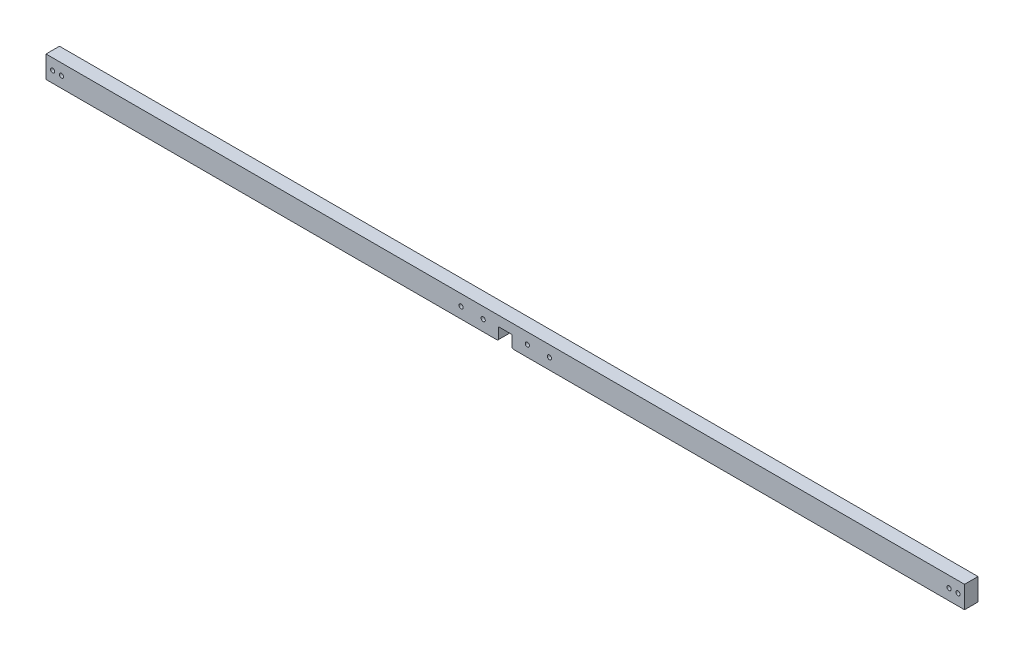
ISO-10303-21;
HEADER;
FILE_DESCRIPTION(('STEP AP214'),'2;1');
FILE_NAME('part.step','',(''),(''),'','','');
FILE_SCHEMA(('AUTOMOTIVE_DESIGN { 1 0 10303 214 1 1 1 1 }'));
ENDSEC;
DATA;
#1=APPLICATION_CONTEXT('core data for automotive mechanical design processes');
#2=APPLICATION_PROTOCOL_DEFINITION('international standard','automotive_design',2000,#1);
#3=PRODUCT_CONTEXT('',#1,'mechanical');
#4=PRODUCT('Part','Part','',(#3));
#5=PRODUCT_RELATED_PRODUCT_CATEGORY('part','',(#4));
#6=PRODUCT_DEFINITION_FORMATION('','',#4);
#7=PRODUCT_DEFINITION_CONTEXT('part definition',#1,'design');
#8=PRODUCT_DEFINITION('design','',#6,#7);
#9=PRODUCT_DEFINITION_SHAPE('','',#8);
#10=(LENGTH_UNIT() NAMED_UNIT(*) SI_UNIT(.MILLI.,.METRE.));
#11=(NAMED_UNIT(*) PLANE_ANGLE_UNIT() SI_UNIT($,.RADIAN.));
#12=(NAMED_UNIT(*) SI_UNIT($,.STERADIAN.) SOLID_ANGLE_UNIT());
#13=UNCERTAINTY_MEASURE_WITH_UNIT(LENGTH_MEASURE(1.E-05),#10,'distance_accuracy_value','');
#14=(GEOMETRIC_REPRESENTATION_CONTEXT(3) GLOBAL_UNCERTAINTY_ASSIGNED_CONTEXT((#13)) GLOBAL_UNIT_ASSIGNED_CONTEXT((#10,
#11,#12)) REPRESENTATION_CONTEXT('',''));
#15=CARTESIAN_POINT('',(0.,0.,0.));
#16=DIRECTION('',(0.,0.,1.));
#17=DIRECTION('',(1.,0.,0.));
#18=AXIS2_PLACEMENT_3D('',#15,#16,#17);
#19=CARTESIAN_POINT('',(208.,-4.99999999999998,3.05));
#20=DIRECTION('',(0.,1.,0.));
#21=DIRECTION('',(-1.,0.,0.));
#22=AXIS2_PLACEMENT_3D('',#19,#20,#21);
#23=PLANE('',#22);
#24=DIRECTION('',(1.,0.,0.));
#25=VECTOR('',#24,1.);
#26=CARTESIAN_POINT('',(208.,-4.99999999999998,3.05));
#27=LINE('',#26,#25);
#28=CARTESIAN_POINT('',(3.50000000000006,-5.,3.05));
#29=VERTEX_POINT('',#28);
#30=CARTESIAN_POINT('',(208.,-4.99999999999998,3.05));
#31=VERTEX_POINT('',#30);
#32=EDGE_CURVE('E189',#29,#31,#27,.T.);
#33=ORIENTED_EDGE('',*,*,#32,.F.);
#34=DIRECTION('',(0.,0.,-1.));
#35=VECTOR('',#34,1.);
#36=CARTESIAN_POINT('',(3.5,-5.,3.05));
#37=LINE('',#36,#35);
#38=CARTESIAN_POINT('',(3.50000000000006,-5.,-3.05));
#39=VERTEX_POINT('',#38);
#40=EDGE_CURVE('E224',#29,#39,#37,.T.);
#41=ORIENTED_EDGE('',*,*,#40,.T.);
#42=DIRECTION('',(1.,0.,0.));
#43=VECTOR('',#42,1.);
#44=CARTESIAN_POINT('',(208.,-4.99999999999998,-3.05));
#45=LINE('',#44,#43);
#46=CARTESIAN_POINT('',(208.,-4.99999999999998,-3.05));
#47=VERTEX_POINT('',#46);
#48=EDGE_CURVE('E200',#39,#47,#45,.T.);
#49=ORIENTED_EDGE('',*,*,#48,.T.);
#50=DIRECTION('',(0.,0.,-1.));
#51=VECTOR('',#50,1.);
#52=CARTESIAN_POINT('',(208.,-4.99999999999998,3.05));
#53=LINE('',#52,#51);
#54=EDGE_CURVE('E212',#31,#47,#53,.T.);
#55=ORIENTED_EDGE('',*,*,#54,.F.);
#56=EDGE_LOOP('',(#33,#41,#49,#55));
#57=FACE_BOUND('',#56,.T.);
#58=ADVANCED_FACE('F34',(#57),#23,.F.);
#59=CARTESIAN_POINT('',(-208.,-5.00000000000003,3.05));
#60=DIRECTION('',(1.,0.,0.));
#61=DIRECTION('',(0.,0.,-1.));
#62=AXIS2_PLACEMENT_3D('',#59,#60,#61);
#63=PLANE('',#62);
#64=DIRECTION('',(0.,-1.,0.));
#65=VECTOR('',#64,1.);
#66=CARTESIAN_POINT('',(-208.,-5.00000000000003,-3.05));
#67=LINE('',#66,#65);
#68=CARTESIAN_POINT('',(-208.,4.99999999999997,-3.05));
#69=VERTEX_POINT('',#68);
#70=CARTESIAN_POINT('',(-208.,-5.00000000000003,-3.05));
#71=VERTEX_POINT('',#70);
#72=EDGE_CURVE('E165',#69,#71,#67,.T.);
#73=ORIENTED_EDGE('',*,*,#72,.T.);
#74=DIRECTION('',(0.,0.,-1.));
#75=VECTOR('',#74,1.);
#76=CARTESIAN_POINT('',(-208.,-5.00000000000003,3.05));
#77=LINE('',#76,#75);
#78=CARTESIAN_POINT('',(-208.,-5.00000000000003,3.05));
#79=VERTEX_POINT('',#78);
#80=EDGE_CURVE('E215',#79,#71,#77,.T.);
#81=ORIENTED_EDGE('',*,*,#80,.F.);
#82=DIRECTION('',(0.,-1.,0.));
#83=VECTOR('',#82,1.);
#84=CARTESIAN_POINT('',(-208.,-5.00000000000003,3.05));
#85=LINE('',#84,#83);
#86=CARTESIAN_POINT('',(-208.,4.99999999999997,3.05));
#87=VERTEX_POINT('',#86);
#88=EDGE_CURVE('E186',#87,#79,#85,.T.);
#89=ORIENTED_EDGE('',*,*,#88,.F.);
#90=DIRECTION('',(0.,0.,-1.));
#91=VECTOR('',#90,1.);
#92=CARTESIAN_POINT('',(-208.,4.99999999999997,3.05));
#93=LINE('',#92,#91);
#94=EDGE_CURVE('E197',#87,#69,#93,.T.);
#95=ORIENTED_EDGE('',*,*,#94,.T.);
#96=EDGE_LOOP('',(#73,#81,#89,#95));
#97=FACE_BOUND('',#96,.T.);
#98=ADVANCED_FACE('F242',(#97),#63,.F.);
#99=CARTESIAN_POINT('',(-3.5,-5.,-3.05));
#100=VERTEX_POINT('',#99);
#101=EDGE_CURVE('E201',#71,#100,#45,.T.);
#102=ORIENTED_EDGE('',*,*,#101,.T.);
#103=DIRECTION('',(0.,0.,1.));
#104=VECTOR('',#103,1.);
#105=CARTESIAN_POINT('',(-3.50000000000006,-5.,3.05));
#106=LINE('',#105,#104);
#107=CARTESIAN_POINT('',(-3.5,-5.,3.05));
#108=VERTEX_POINT('',#107);
#109=EDGE_CURVE('E42',#100,#108,#106,.T.);
#110=ORIENTED_EDGE('',*,*,#109,.T.);
#111=EDGE_CURVE('E191',#79,#108,#27,.T.);
#112=ORIENTED_EDGE('',*,*,#111,.F.);
#113=ORIENTED_EDGE('',*,*,#80,.T.);
#114=EDGE_LOOP('',(#102,#110,#112,#113));
#115=FACE_BOUND('',#114,.T.);
#116=ADVANCED_FACE('F235',(#115),#23,.F.);
#117=CARTESIAN_POINT('',(208.,-4.99999999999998,3.05));
#118=DIRECTION('',(-1.,0.,0.));
#119=DIRECTION('',(0.,0.,1.));
#120=AXIS2_PLACEMENT_3D('',#117,#118,#119);
#121=PLANE('',#120);
#122=DIRECTION('',(0.,1.,0.));
#123=VECTOR('',#122,1.);
#124=CARTESIAN_POINT('',(208.,-4.99999999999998,-3.05));
#125=LINE('',#124,#123);
#126=CARTESIAN_POINT('',(208.,5.00000000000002,-3.05));
#127=VERTEX_POINT('',#126);
#128=EDGE_CURVE('E204',#47,#127,#125,.T.);
#129=ORIENTED_EDGE('',*,*,#128,.T.);
#130=DIRECTION('',(0.,0.,-1.));
#131=VECTOR('',#130,1.);
#132=CARTESIAN_POINT('',(208.,5.00000000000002,3.05));
#133=LINE('',#132,#131);
#134=CARTESIAN_POINT('',(208.,5.00000000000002,3.05));
#135=VERTEX_POINT('',#134);
#136=EDGE_CURVE('E209',#135,#127,#133,.T.);
#137=ORIENTED_EDGE('',*,*,#136,.F.);
#138=DIRECTION('',(0.,1.,0.));
#139=VECTOR('',#138,1.);
#140=CARTESIAN_POINT('',(208.,-4.99999999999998,3.05));
#141=LINE('',#140,#139);
#142=EDGE_CURVE('E193',#31,#135,#141,.T.);
#143=ORIENTED_EDGE('',*,*,#142,.F.);
#144=ORIENTED_EDGE('',*,*,#54,.T.);
#145=EDGE_LOOP('',(#129,#137,#143,#144));
#146=FACE_BOUND('',#145,.T.);
#147=ADVANCED_FACE('F262',(#146),#121,.F.);
#148=CARTESIAN_POINT('',(208.,5.00000000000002,3.05));
#149=DIRECTION('',(0.,-1.,0.));
#150=DIRECTION('',(1.,0.,0.));
#151=AXIS2_PLACEMENT_3D('',#148,#149,#150);
#152=PLANE('',#151);
#153=DIRECTION('',(-1.,0.,0.));
#154=VECTOR('',#153,1.);
#155=CARTESIAN_POINT('',(208.,5.00000000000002,-3.05));
#156=LINE('',#155,#154);
#157=EDGE_CURVE('E190',#127,#69,#156,.T.);
#158=ORIENTED_EDGE('',*,*,#157,.T.);
#159=ORIENTED_EDGE('',*,*,#94,.F.);
#160=DIRECTION('',(-1.,0.,0.));
#161=VECTOR('',#160,1.);
#162=CARTESIAN_POINT('',(208.,5.00000000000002,3.05));
#163=LINE('',#162,#161);
#164=EDGE_CURVE('E195',#135,#87,#163,.T.);
#165=ORIENTED_EDGE('',*,*,#164,.F.);
#166=ORIENTED_EDGE('',*,*,#136,.T.);
#167=EDGE_LOOP('',(#158,#159,#165,#166));
#168=FACE_BOUND('',#167,.T.);
#169=ADVANCED_FACE('F264',(#168),#152,.F.);
#170=CARTESIAN_POINT('',(0.,0.,3.05));
#171=DIRECTION('',(0.,0.,1.));
#172=DIRECTION('',(1.,0.,0.));
#173=AXIS2_PLACEMENT_3D('',#170,#171,#172);
#174=PLANE('',#173);
#175=DIRECTION('',(0.,1.,0.));
#176=VECTOR('',#175,1.);
#177=CARTESIAN_POINT('',(3.,-12.5622462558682,3.05));
#178=LINE('',#177,#176);
#179=CARTESIAN_POINT('',(3.,-4.50000000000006,3.05));
#180=VERTEX_POINT('',#179);
#181=CARTESIAN_POINT('',(3.,0.5,3.05));
#182=VERTEX_POINT('',#181);
#183=EDGE_CURVE('E111',#180,#182,#178,.T.);
#184=ORIENTED_EDGE('',*,*,#183,.F.);
#185=DIRECTION('',(-0.707106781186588,0.707106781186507,0.));
#186=VECTOR('',#185,1.);
#187=CARTESIAN_POINT('',(-0.750000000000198,-0.750000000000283,3.05));
#188=LINE('',#187,#186);
#189=EDGE_CURVE('E233',#180,#29,#188,.F.);
#190=ORIENTED_EDGE('',*,*,#189,.T.);
#191=ORIENTED_EDGE('',*,*,#32,.T.);
#192=ORIENTED_EDGE('',*,*,#142,.T.);
#193=ORIENTED_EDGE('',*,*,#164,.T.);
#194=ORIENTED_EDGE('',*,*,#88,.T.);
#195=ORIENTED_EDGE('',*,*,#111,.T.);
#196=DIRECTION('',(-0.707106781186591,-0.707106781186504,0.));
#197=VECTOR('',#196,1.);
#198=CARTESIAN_POINT('',(0.750000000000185,-0.750000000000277,3.05));
#199=LINE('',#198,#197);
#200=CARTESIAN_POINT('',(-3.,-4.50000000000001,3.05));
#201=VERTEX_POINT('',#200);
#202=EDGE_CURVE('E49',#108,#201,#199,.F.);
#203=ORIENTED_EDGE('',*,*,#202,.T.);
#204=DIRECTION('',(0.,-1.,0.));
#205=VECTOR('',#204,1.);
#206=CARTESIAN_POINT('',(-3.,-12.5622462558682,3.05));
#207=LINE('',#206,#205);
#208=CARTESIAN_POINT('',(-3.,0.5,3.05));
#209=VERTEX_POINT('',#208);
#210=EDGE_CURVE('E129',#209,#201,#207,.T.);
#211=ORIENTED_EDGE('',*,*,#210,.F.);
#212=DIRECTION('',(-1.,0.,0.));
#213=VECTOR('',#212,1.);
#214=CARTESIAN_POINT('',(-3.,0.5,3.05));
#215=LINE('',#214,#213);
#216=EDGE_CURVE('E120',#182,#209,#215,.T.);
#217=ORIENTED_EDGE('',*,*,#216,.F.);
#218=EDGE_LOOP('',(#184,#190,#191,#192,#193,#194,#195,#203,#211,#217));
#219=FACE_BOUND('',#218,.T.);
#220=CARTESIAN_POINT('',(-10.,0.,3.05));
#221=DIRECTION('',(0.,0.,-1.));
#222=DIRECTION('',(-1.,0.,0.));
#223=AXIS2_PLACEMENT_3D('',#220,#221,#222);
#224=CIRCLE('',#223,0.949999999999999);
#225=CARTESIAN_POINT('',(-10.95,0.,3.05));
#226=VERTEX_POINT('',#225);
#227=EDGE_CURVE('E142',#226,#226,#224,.T.);
#228=ORIENTED_EDGE('',*,*,#227,.T.);
#229=EDGE_LOOP('',(#228));
#230=FACE_BOUND('',#229,.T.);
#231=CARTESIAN_POINT('',(-201.,0.,3.05));
#232=DIRECTION('',(0.,0.,-1.));
#233=DIRECTION('',(-1.,0.,0.));
#234=AXIS2_PLACEMENT_3D('',#231,#232,#233);
#235=CIRCLE('',#234,0.950000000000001);
#236=CARTESIAN_POINT('',(-201.95,0.,3.05));
#237=VERTEX_POINT('',#236);
#238=EDGE_CURVE('E136',#237,#237,#235,.T.);
#239=ORIENTED_EDGE('',*,*,#238,.T.);
#240=EDGE_LOOP('',(#239));
#241=FACE_BOUND('',#240,.T.);
#242=CARTESIAN_POINT('',(-205.,0.,3.05));
#243=DIRECTION('',(0.,0.,-1.));
#244=DIRECTION('',(-1.,0.,0.));
#245=AXIS2_PLACEMENT_3D('',#242,#243,#244);
#246=CIRCLE('',#245,0.950000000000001);
#247=CARTESIAN_POINT('',(-205.95,0.,3.05));
#248=VERTEX_POINT('',#247);
#249=EDGE_CURVE('E149',#248,#248,#246,.T.);
#250=ORIENTED_EDGE('',*,*,#249,.T.);
#251=EDGE_LOOP('',(#250));
#252=FACE_BOUND('',#251,.T.);
#253=CARTESIAN_POINT('',(-20.,0.,3.05));
#254=DIRECTION('',(0.,0.,-1.));
#255=DIRECTION('',(-1.,0.,0.));
#256=AXIS2_PLACEMENT_3D('',#253,#254,#255);
#257=CIRCLE('',#256,0.950000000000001);
#258=CARTESIAN_POINT('',(-20.95,0.,3.05));
#259=VERTEX_POINT('',#258);
#260=EDGE_CURVE('E154',#259,#259,#257,.T.);
#261=ORIENTED_EDGE('',*,*,#260,.T.);
#262=EDGE_LOOP('',(#261));
#263=FACE_BOUND('',#262,.T.);
#264=CARTESIAN_POINT('',(10.,0.,3.05));
#265=DIRECTION('',(0.,0.,1.));
#266=DIRECTION('',(1.,0.,0.));
#267=AXIS2_PLACEMENT_3D('',#264,#265,#266);
#268=CIRCLE('',#267,0.949999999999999);
#269=CARTESIAN_POINT('',(10.95,0.,3.05));
#270=VERTEX_POINT('',#269);
#271=EDGE_CURVE('E166',#270,#270,#268,.T.);
#272=ORIENTED_EDGE('',*,*,#271,.F.);
#273=EDGE_LOOP('',(#272));
#274=FACE_BOUND('',#273,.T.);
#275=CARTESIAN_POINT('',(201.,0.,3.05));
#276=DIRECTION('',(0.,0.,1.));
#277=DIRECTION('',(1.,0.,0.));
#278=AXIS2_PLACEMENT_3D('',#275,#276,#277);
#279=CIRCLE('',#278,0.950000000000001);
#280=CARTESIAN_POINT('',(201.95,0.,3.05));
#281=VERTEX_POINT('',#280);
#282=EDGE_CURVE('E141',#281,#281,#279,.T.);
#283=ORIENTED_EDGE('',*,*,#282,.F.);
#284=EDGE_LOOP('',(#283));
#285=FACE_BOUND('',#284,.T.);
#286=CARTESIAN_POINT('',(205.,0.,3.05));
#287=DIRECTION('',(0.,0.,1.));
#288=DIRECTION('',(1.,0.,0.));
#289=AXIS2_PLACEMENT_3D('',#286,#287,#288);
#290=CIRCLE('',#289,0.950000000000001);
#291=CARTESIAN_POINT('',(205.95,0.,3.05));
#292=VERTEX_POINT('',#291);
#293=EDGE_CURVE('E173',#292,#292,#290,.T.);
#294=ORIENTED_EDGE('',*,*,#293,.F.);
#295=EDGE_LOOP('',(#294));
#296=FACE_BOUND('',#295,.T.);
#297=CARTESIAN_POINT('',(20.,0.,3.05));
#298=DIRECTION('',(0.,0.,1.));
#299=DIRECTION('',(1.,0.,0.));
#300=AXIS2_PLACEMENT_3D('',#297,#298,#299);
#301=CIRCLE('',#300,0.950000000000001);
#302=CARTESIAN_POINT('',(20.95,0.,3.05));
#303=VERTEX_POINT('',#302);
#304=EDGE_CURVE('E178',#303,#303,#301,.T.);
#305=ORIENTED_EDGE('',*,*,#304,.F.);
#306=EDGE_LOOP('',(#305));
#307=FACE_BOUND('',#306,.T.);
#308=ADVANCED_FACE('F131',(#219,#230,#241,#252,#263,#274,#285,#296,#307),#174,.T.);
#309=CARTESIAN_POINT('',(0.,0.,-3.05));
#310=DIRECTION('',(0.,0.,1.));
#311=DIRECTION('',(1.,0.,0.));
#312=AXIS2_PLACEMENT_3D('',#309,#310,#311);
#313=PLANE('',#312);
#314=ORIENTED_EDGE('',*,*,#48,.F.);
#315=DIRECTION('',(0.707106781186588,-0.707106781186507,0.));
#316=VECTOR('',#315,1.);
#317=CARTESIAN_POINT('',(3.5,-5.,-3.05));
#318=LINE('',#317,#316);
#319=CARTESIAN_POINT('',(3.,-4.50000000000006,-3.05));
#320=VERTEX_POINT('',#319);
#321=EDGE_CURVE('E229',#39,#320,#318,.F.);
#322=ORIENTED_EDGE('',*,*,#321,.T.);
#323=DIRECTION('',(0.,1.,0.));
#324=VECTOR('',#323,1.);
#325=CARTESIAN_POINT('',(3.,0.,-3.05));
#326=LINE('',#325,#324);
#327=CARTESIAN_POINT('',(3.,0.5,-3.05));
#328=VERTEX_POINT('',#327);
#329=EDGE_CURVE('E222',#320,#328,#326,.T.);
#330=ORIENTED_EDGE('',*,*,#329,.T.);
#331=DIRECTION('',(-1.,0.,0.));
#332=VECTOR('',#331,1.);
#333=CARTESIAN_POINT('',(0.,0.5,-3.05));
#334=LINE('',#333,#332);
#335=CARTESIAN_POINT('',(-3.,0.5,-3.05));
#336=VERTEX_POINT('',#335);
#337=EDGE_CURVE('E127',#328,#336,#334,.T.);
#338=ORIENTED_EDGE('',*,*,#337,.T.);
#339=DIRECTION('',(0.,-1.,0.));
#340=VECTOR('',#339,1.);
#341=CARTESIAN_POINT('',(-3.,0.,-3.05));
#342=LINE('',#341,#340);
#343=CARTESIAN_POINT('',(-3.,-4.5,-3.05));
#344=VERTEX_POINT('',#343);
#345=EDGE_CURVE('E219',#336,#344,#342,.T.);
#346=ORIENTED_EDGE('',*,*,#345,.T.);
#347=DIRECTION('',(0.707106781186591,0.707106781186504,0.));
#348=VECTOR('',#347,1.);
#349=CARTESIAN_POINT('',(-3.50000000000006,-5.,-3.05));
#350=LINE('',#349,#348);
#351=EDGE_CURVE('E227',#344,#100,#350,.F.);
#352=ORIENTED_EDGE('',*,*,#351,.T.);
#353=ORIENTED_EDGE('',*,*,#101,.F.);
#354=ORIENTED_EDGE('',*,*,#72,.F.);
#355=ORIENTED_EDGE('',*,*,#157,.F.);
#356=ORIENTED_EDGE('',*,*,#128,.F.);
#357=EDGE_LOOP('',(#314,#322,#330,#338,#346,#352,#353,#354,#355,#356));
#358=FACE_BOUND('',#357,.T.);
#359=CARTESIAN_POINT('',(-10.,0.,-3.05));
#360=DIRECTION('',(0.,0.,-1.));
#361=DIRECTION('',(-1.,0.,0.));
#362=AXIS2_PLACEMENT_3D('',#359,#360,#361);
#363=CIRCLE('',#362,0.949999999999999);
#364=CARTESIAN_POINT('',(-10.95,0.,-3.05));
#365=VERTEX_POINT('',#364);
#366=EDGE_CURVE('E138',#365,#365,#363,.T.);
#367=ORIENTED_EDGE('',*,*,#366,.F.);
#368=EDGE_LOOP('',(#367));
#369=FACE_BOUND('',#368,.T.);
#370=CARTESIAN_POINT('',(-201.,0.,-3.05));
#371=DIRECTION('',(0.,0.,-1.));
#372=DIRECTION('',(-1.,0.,0.));
#373=AXIS2_PLACEMENT_3D('',#370,#371,#372);
#374=CIRCLE('',#373,0.950000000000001);
#375=CARTESIAN_POINT('',(-201.95,0.,-3.05));
#376=VERTEX_POINT('',#375);
#377=EDGE_CURVE('E146',#376,#376,#374,.T.);
#378=ORIENTED_EDGE('',*,*,#377,.F.);
#379=EDGE_LOOP('',(#378));
#380=FACE_BOUND('',#379,.T.);
#381=CARTESIAN_POINT('',(-205.,0.,-3.05));
#382=DIRECTION('',(0.,0.,-1.));
#383=DIRECTION('',(-1.,0.,0.));
#384=AXIS2_PLACEMENT_3D('',#381,#382,#383);
#385=CIRCLE('',#384,0.950000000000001);
#386=CARTESIAN_POINT('',(-205.95,0.,-3.05));
#387=VERTEX_POINT('',#386);
#388=EDGE_CURVE('E157',#387,#387,#385,.T.);
#389=ORIENTED_EDGE('',*,*,#388,.F.);
#390=EDGE_LOOP('',(#389));
#391=FACE_BOUND('',#390,.T.);
#392=CARTESIAN_POINT('',(-20.,0.,-3.05));
#393=DIRECTION('',(0.,0.,-1.));
#394=DIRECTION('',(-1.,0.,0.));
#395=AXIS2_PLACEMENT_3D('',#392,#393,#394);
#396=CIRCLE('',#395,0.950000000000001);
#397=CARTESIAN_POINT('',(-20.95,0.,-3.05));
#398=VERTEX_POINT('',#397);
#399=EDGE_CURVE('E145',#398,#398,#396,.T.);
#400=ORIENTED_EDGE('',*,*,#399,.F.);
#401=EDGE_LOOP('',(#400));
#402=FACE_BOUND('',#401,.T.);
#403=CARTESIAN_POINT('',(10.,0.,-3.05));
#404=DIRECTION('',(0.,0.,1.));
#405=DIRECTION('',(1.,0.,0.));
#406=AXIS2_PLACEMENT_3D('',#403,#404,#405);
#407=CIRCLE('',#406,0.949999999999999);
#408=CARTESIAN_POINT('',(10.95,0.,-3.05));
#409=VERTEX_POINT('',#408);
#410=EDGE_CURVE('E162',#409,#409,#407,.T.);
#411=ORIENTED_EDGE('',*,*,#410,.T.);
#412=EDGE_LOOP('',(#411));
#413=FACE_BOUND('',#412,.T.);
#414=CARTESIAN_POINT('',(201.,0.,-3.05));
#415=DIRECTION('',(0.,0.,1.));
#416=DIRECTION('',(1.,0.,0.));
#417=AXIS2_PLACEMENT_3D('',#414,#415,#416);
#418=CIRCLE('',#417,0.950000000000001);
#419=CARTESIAN_POINT('',(201.95,0.,-3.05));
#420=VERTEX_POINT('',#419);
#421=EDGE_CURVE('E170',#420,#420,#418,.T.);
#422=ORIENTED_EDGE('',*,*,#421,.T.);
#423=EDGE_LOOP('',(#422));
#424=FACE_BOUND('',#423,.T.);
#425=CARTESIAN_POINT('',(205.,0.,-3.05));
#426=DIRECTION('',(0.,0.,1.));
#427=DIRECTION('',(1.,0.,0.));
#428=AXIS2_PLACEMENT_3D('',#425,#426,#427);
#429=CIRCLE('',#428,0.950000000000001);
#430=CARTESIAN_POINT('',(205.95,0.,-3.05));
#431=VERTEX_POINT('',#430);
#432=EDGE_CURVE('E181',#431,#431,#429,.T.);
#433=ORIENTED_EDGE('',*,*,#432,.T.);
#434=EDGE_LOOP('',(#433));
#435=FACE_BOUND('',#434,.T.);
#436=CARTESIAN_POINT('',(20.,0.,-3.05));
#437=DIRECTION('',(0.,0.,1.));
#438=DIRECTION('',(1.,0.,0.));
#439=AXIS2_PLACEMENT_3D('',#436,#437,#438);
#440=CIRCLE('',#439,0.950000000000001);
#441=CARTESIAN_POINT('',(20.95,0.,-3.05));
#442=VERTEX_POINT('',#441);
#443=EDGE_CURVE('E169',#442,#442,#440,.T.);
#444=ORIENTED_EDGE('',*,*,#443,.T.);
#445=EDGE_LOOP('',(#444));
#446=FACE_BOUND('',#445,.T.);
#447=ADVANCED_FACE('F247',(#358,#369,#380,#391,#402,#413,#424,#435,#446),#313,.F.);
#448=CARTESIAN_POINT('',(20.,0.,-3.05));
#449=DIRECTION('',(0.,0.,1.));
#450=DIRECTION('',(1.,0.,0.));
#451=AXIS2_PLACEMENT_3D('',#448,#449,#450);
#452=CYLINDRICAL_SURFACE('',#451,0.950000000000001);
#453=ORIENTED_EDGE('',*,*,#443,.F.);
#454=EDGE_LOOP('',(#453));
#455=FACE_BOUND('',#454,.T.);
#456=ORIENTED_EDGE('',*,*,#304,.T.);
#457=EDGE_LOOP('',(#456));
#458=FACE_BOUND('',#457,.T.);
#459=ADVANCED_FACE('F302',(#455,#458),#452,.F.);
#460=CARTESIAN_POINT('',(205.,0.,-3.05));
#461=DIRECTION('',(0.,0.,1.));
#462=DIRECTION('',(1.,0.,0.));
#463=AXIS2_PLACEMENT_3D('',#460,#461,#462);
#464=CYLINDRICAL_SURFACE('',#463,0.950000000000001);
#465=ORIENTED_EDGE('',*,*,#432,.F.);
#466=EDGE_LOOP('',(#465));
#467=FACE_BOUND('',#466,.T.);
#468=ORIENTED_EDGE('',*,*,#293,.T.);
#469=EDGE_LOOP('',(#468));
#470=FACE_BOUND('',#469,.T.);
#471=ADVANCED_FACE('F307',(#467,#470),#464,.F.);
#472=CARTESIAN_POINT('',(201.,0.,-3.05));
#473=DIRECTION('',(0.,0.,1.));
#474=DIRECTION('',(1.,0.,0.));
#475=AXIS2_PLACEMENT_3D('',#472,#473,#474);
#476=CYLINDRICAL_SURFACE('',#475,0.950000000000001);
#477=ORIENTED_EDGE('',*,*,#421,.F.);
#478=EDGE_LOOP('',(#477));
#479=FACE_BOUND('',#478,.T.);
#480=ORIENTED_EDGE('',*,*,#282,.T.);
#481=EDGE_LOOP('',(#480));
#482=FACE_BOUND('',#481,.T.);
#483=ADVANCED_FACE('F319',(#479,#482),#476,.F.);
#484=CARTESIAN_POINT('',(10.,0.,-3.05));
#485=DIRECTION('',(0.,0.,1.));
#486=DIRECTION('',(1.,0.,0.));
#487=AXIS2_PLACEMENT_3D('',#484,#485,#486);
#488=CYLINDRICAL_SURFACE('',#487,0.949999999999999);
#489=ORIENTED_EDGE('',*,*,#410,.F.);
#490=EDGE_LOOP('',(#489));
#491=FACE_BOUND('',#490,.T.);
#492=ORIENTED_EDGE('',*,*,#271,.T.);
#493=EDGE_LOOP('',(#492));
#494=FACE_BOUND('',#493,.T.);
#495=ADVANCED_FACE('F329',(#491,#494),#488,.F.);
#496=CARTESIAN_POINT('',(-20.,0.,-3.05));
#497=DIRECTION('',(0.,0.,1.));
#498=DIRECTION('',(1.,0.,0.));
#499=AXIS2_PLACEMENT_3D('',#496,#497,#498);
#500=CYLINDRICAL_SURFACE('',#499,0.950000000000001);
#501=ORIENTED_EDGE('',*,*,#399,.T.);
#502=EDGE_LOOP('',(#501));
#503=FACE_BOUND('',#502,.T.);
#504=ORIENTED_EDGE('',*,*,#260,.F.);
#505=EDGE_LOOP('',(#504));
#506=FACE_BOUND('',#505,.T.);
#507=ADVANCED_FACE('F339',(#503,#506),#500,.F.);
#508=CARTESIAN_POINT('',(-205.,0.,-3.05));
#509=DIRECTION('',(0.,0.,1.));
#510=DIRECTION('',(1.,0.,0.));
#511=AXIS2_PLACEMENT_3D('',#508,#509,#510);
#512=CYLINDRICAL_SURFACE('',#511,0.950000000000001);
#513=ORIENTED_EDGE('',*,*,#388,.T.);
#514=EDGE_LOOP('',(#513));
#515=FACE_BOUND('',#514,.T.);
#516=ORIENTED_EDGE('',*,*,#249,.F.);
#517=EDGE_LOOP('',(#516));
#518=FACE_BOUND('',#517,.T.);
#519=ADVANCED_FACE('F349',(#515,#518),#512,.F.);
#520=CARTESIAN_POINT('',(-201.,0.,-3.05));
#521=DIRECTION('',(0.,0.,1.));
#522=DIRECTION('',(1.,0.,0.));
#523=AXIS2_PLACEMENT_3D('',#520,#521,#522);
#524=CYLINDRICAL_SURFACE('',#523,0.950000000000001);
#525=ORIENTED_EDGE('',*,*,#377,.T.);
#526=EDGE_LOOP('',(#525));
#527=FACE_BOUND('',#526,.T.);
#528=ORIENTED_EDGE('',*,*,#238,.F.);
#529=EDGE_LOOP('',(#528));
#530=FACE_BOUND('',#529,.T.);
#531=ADVANCED_FACE('F359',(#527,#530),#524,.F.);
#532=CARTESIAN_POINT('',(-10.,0.,-3.05));
#533=DIRECTION('',(0.,0.,1.));
#534=DIRECTION('',(1.,0.,0.));
#535=AXIS2_PLACEMENT_3D('',#532,#533,#534);
#536=CYLINDRICAL_SURFACE('',#535,0.949999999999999);
#537=ORIENTED_EDGE('',*,*,#366,.T.);
#538=EDGE_LOOP('',(#537));
#539=FACE_BOUND('',#538,.T.);
#540=ORIENTED_EDGE('',*,*,#227,.F.);
#541=EDGE_LOOP('',(#540));
#542=FACE_BOUND('',#541,.T.);
#543=ADVANCED_FACE('F369',(#539,#542),#536,.F.);
#544=CARTESIAN_POINT('',(3.,-12.5622462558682,-6.95));
#545=DIRECTION('',(1.,0.,0.));
#546=DIRECTION('',(0.,0.,-1.));
#547=AXIS2_PLACEMENT_3D('',#544,#545,#546);
#548=PLANE('',#547);
#549=ORIENTED_EDGE('',*,*,#329,.F.);
#550=DIRECTION('',(0.,0.,1.));
#551=VECTOR('',#550,1.);
#552=CARTESIAN_POINT('',(3.,-4.50000000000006,-6.95));
#553=LINE('',#552,#551);
#554=EDGE_CURVE('E117',#320,#180,#553,.T.);
#555=ORIENTED_EDGE('',*,*,#554,.T.);
#556=ORIENTED_EDGE('',*,*,#183,.T.);
#557=DIRECTION('',(0.,0.,1.));
#558=VECTOR('',#557,1.);
#559=CARTESIAN_POINT('',(3.,0.5,-6.95));
#560=LINE('',#559,#558);
#561=EDGE_CURVE('E115',#328,#182,#560,.T.);
#562=ORIENTED_EDGE('',*,*,#561,.F.);
#563=EDGE_LOOP('',(#549,#555,#556,#562));
#564=FACE_BOUND('',#563,.T.);
#565=ADVANCED_FACE('F114',(#564),#548,.F.);
#566=CARTESIAN_POINT('',(-3.,-12.5622462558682,-6.95));
#567=DIRECTION('',(-1.,0.,0.));
#568=DIRECTION('',(0.,0.,1.));
#569=AXIS2_PLACEMENT_3D('',#566,#567,#568);
#570=PLANE('',#569);
#571=ORIENTED_EDGE('',*,*,#210,.T.);
#572=DIRECTION('',(0.,0.,-1.));
#573=VECTOR('',#572,1.);
#574=CARTESIAN_POINT('',(-3.,-4.5,-6.95));
#575=LINE('',#574,#573);
#576=EDGE_CURVE('E11',#201,#344,#575,.T.);
#577=ORIENTED_EDGE('',*,*,#576,.T.);
#578=ORIENTED_EDGE('',*,*,#345,.F.);
#579=DIRECTION('',(0.,0.,1.));
#580=VECTOR('',#579,1.);
#581=CARTESIAN_POINT('',(-3.,0.5,-6.95));
#582=LINE('',#581,#580);
#583=EDGE_CURVE('E128',#336,#209,#582,.T.);
#584=ORIENTED_EDGE('',*,*,#583,.T.);
#585=EDGE_LOOP('',(#571,#577,#578,#584));
#586=FACE_BOUND('',#585,.T.);
#587=ADVANCED_FACE('F252',(#586),#570,.F.);
#588=CARTESIAN_POINT('',(-3.,0.5,-6.95));
#589=DIRECTION('',(0.,1.,0.));
#590=DIRECTION('',(0.,0.,1.));
#591=AXIS2_PLACEMENT_3D('',#588,#589,#590);
#592=PLANE('',#591);
#593=ORIENTED_EDGE('',*,*,#561,.T.);
#594=ORIENTED_EDGE('',*,*,#216,.T.);
#595=ORIENTED_EDGE('',*,*,#583,.F.);
#596=ORIENTED_EDGE('',*,*,#337,.F.);
#597=EDGE_LOOP('',(#593,#594,#595,#596));
#598=FACE_BOUND('',#597,.T.);
#599=ADVANCED_FACE('F125',(#598),#592,.F.);
#600=CARTESIAN_POINT('',(3.5,-5.,3.05));
#601=DIRECTION('',(0.707106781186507,0.707106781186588,0.));
#602=DIRECTION('',(0.,0.,-1.));
#603=AXIS2_PLACEMENT_3D('',#600,#601,#602);
#604=PLANE('',#603);
#605=ORIENTED_EDGE('',*,*,#189,.F.);
#606=ORIENTED_EDGE('',*,*,#554,.F.);
#607=ORIENTED_EDGE('',*,*,#321,.F.);
#608=ORIENTED_EDGE('',*,*,#40,.F.);
#609=EDGE_LOOP('',(#605,#606,#607,#608));
#610=FACE_BOUND('',#609,.T.);
#611=ADVANCED_FACE('F254',(#610),#604,.F.);
#612=CARTESIAN_POINT('',(-3.50000000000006,-5.,3.05));
#613=DIRECTION('',(-0.707106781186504,0.707106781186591,0.));
#614=DIRECTION('',(0.,0.,1.));
#615=AXIS2_PLACEMENT_3D('',#612,#613,#614);
#616=PLANE('',#615);
#617=ORIENTED_EDGE('',*,*,#351,.F.);
#618=ORIENTED_EDGE('',*,*,#576,.F.);
#619=ORIENTED_EDGE('',*,*,#202,.F.);
#620=ORIENTED_EDGE('',*,*,#109,.F.);
#621=EDGE_LOOP('',(#617,#618,#619,#620));
#622=FACE_BOUND('',#621,.T.);
#623=ADVANCED_FACE('F36',(#622),#616,.F.);
#624=CLOSED_SHELL('',(#58,#98,#116,#147,#169,#308,#447,#459,#471,#483,#495,#507,#519,#531,#543,
#565,#587,#599,#611,#623));
#625=MANIFOLD_SOLID_BREP('B2',#624);
#626=ADVANCED_BREP_SHAPE_REPRESENTATION('',(#18,#625),#14);
#627=SHAPE_DEFINITION_REPRESENTATION(#9,#626);
ENDSEC;
END-ISO-10303-21;
